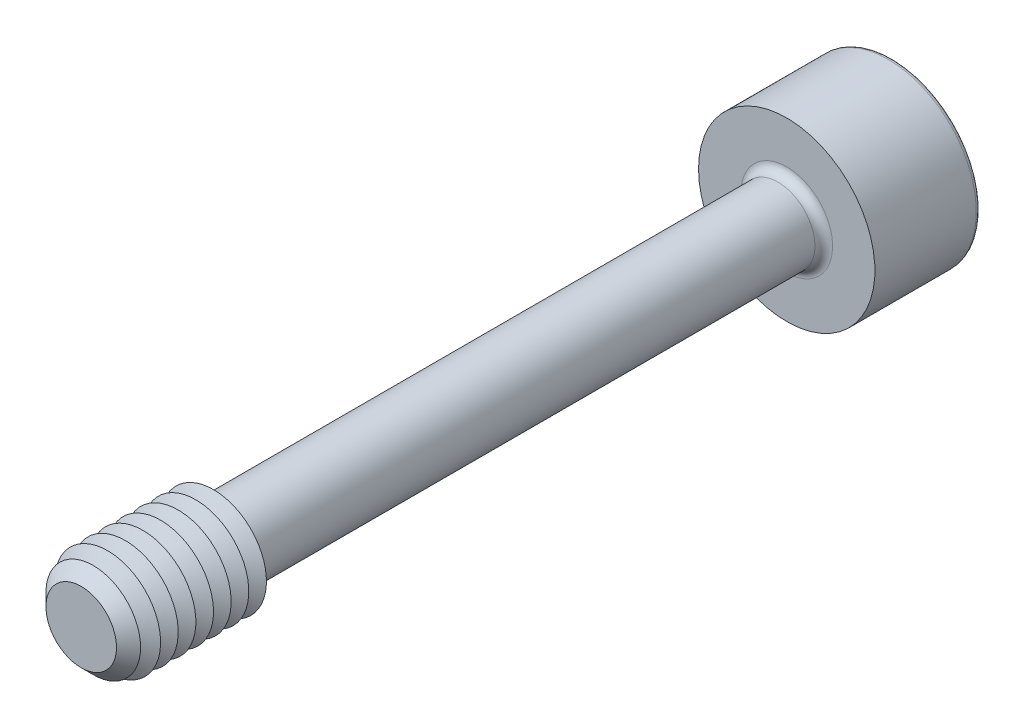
ISO-10303-21;
HEADER;
FILE_DESCRIPTION(('STEP AP214'),'2;1');
FILE_NAME('part.step','',(''),(''),'','','');
FILE_SCHEMA(('AUTOMOTIVE_DESIGN { 1 0 10303 214 1 1 1 1 }'));
ENDSEC;
DATA;
#1=APPLICATION_CONTEXT('core data for automotive mechanical design processes');
#2=APPLICATION_PROTOCOL_DEFINITION('international standard','automotive_design',2000,#1);
#3=PRODUCT_CONTEXT('',#1,'mechanical');
#4=PRODUCT('Part','Part','',(#3));
#5=PRODUCT_RELATED_PRODUCT_CATEGORY('part','',(#4));
#6=PRODUCT_DEFINITION_FORMATION('','',#4);
#7=PRODUCT_DEFINITION_CONTEXT('part definition',#1,'design');
#8=PRODUCT_DEFINITION('design','',#6,#7);
#9=PRODUCT_DEFINITION_SHAPE('','',#8);
#10=(LENGTH_UNIT() NAMED_UNIT(*) SI_UNIT(.MILLI.,.METRE.));
#11=(NAMED_UNIT(*) PLANE_ANGLE_UNIT() SI_UNIT($,.RADIAN.));
#12=(NAMED_UNIT(*) SI_UNIT($,.STERADIAN.) SOLID_ANGLE_UNIT());
#13=UNCERTAINTY_MEASURE_WITH_UNIT(LENGTH_MEASURE(1.E-05),#10,'distance_accuracy_value','');
#14=(GEOMETRIC_REPRESENTATION_CONTEXT(3) GLOBAL_UNCERTAINTY_ASSIGNED_CONTEXT((#13)) GLOBAL_UNIT_ASSIGNED_CONTEXT((#10,
#11,#12)) REPRESENTATION_CONTEXT('',''));
#15=CARTESIAN_POINT('',(0.,0.,0.));
#16=DIRECTION('',(0.,0.,1.));
#17=DIRECTION('',(1.,0.,0.));
#18=AXIS2_PLACEMENT_3D('',#15,#16,#17);
#19=CARTESIAN_POINT('',(-1.44337567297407,-2.5,-21.));
#20=DIRECTION('',(0.,0.,1.));
#21=DIRECTION('',(1.,0.,0.));
#22=AXIS2_PLACEMENT_3D('',#19,#20,#21);
#23=PLANE('',#22);
#24=DIRECTION('',(1.,0.,0.));
#25=VECTOR('',#24,1.);
#26=CARTESIAN_POINT('',(-1.44337567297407,-2.5,-21.));
#27=LINE('',#26,#25);
#28=CARTESIAN_POINT('',(0.,-2.5,-21.));
#29=VERTEX_POINT('',#28);
#30=CARTESIAN_POINT('',(1.44337567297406,-2.5,-21.));
#31=VERTEX_POINT('',#30);
#32=EDGE_CURVE('E729',#29,#31,#27,.T.);
#33=ORIENTED_EDGE('',*,*,#32,.F.);
#34=CARTESIAN_POINT('',(0.,0.,-21.));
#35=DIRECTION('',(0.,0.,1.));
#36=DIRECTION('',(0.,-1.,0.));
#37=AXIS2_PLACEMENT_3D('',#34,#35,#36);
#38=CIRCLE('',#37,2.5);
#39=CARTESIAN_POINT('',(2.1650635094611,-1.25,-21.));
#40=VERTEX_POINT('',#39);
#41=EDGE_CURVE('E53',#29,#40,#38,.T.);
#42=ORIENTED_EDGE('',*,*,#41,.T.);
#43=DIRECTION('',(0.5,0.866025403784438,0.));
#44=VECTOR('',#43,1.);
#45=CARTESIAN_POINT('',(1.44337567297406,-2.5,-21.));
#46=LINE('',#45,#44);
#47=EDGE_CURVE('E713',#31,#40,#46,.T.);
#48=ORIENTED_EDGE('',*,*,#47,.F.);
#49=EDGE_LOOP('',(#33,#42,#48));
#50=FACE_BOUND('',#49,.T.);
#51=ADVANCED_FACE('F41',(#50),#23,.F.);
#52=CARTESIAN_POINT('',(2.88675134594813,0.,-21.));
#53=VERTEX_POINT('',#52);
#54=EDGE_CURVE('E725',#40,#53,#46,.T.);
#55=ORIENTED_EDGE('',*,*,#54,.F.);
#56=CARTESIAN_POINT('',(2.1650635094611,1.25,-21.));
#57=VERTEX_POINT('',#56);
#58=EDGE_CURVE('E11',#40,#57,#38,.T.);
#59=ORIENTED_EDGE('',*,*,#58,.T.);
#60=DIRECTION('',(-0.5,0.866025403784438,0.));
#61=VECTOR('',#60,1.);
#62=CARTESIAN_POINT('',(2.88675134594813,0.,-21.));
#63=LINE('',#62,#61);
#64=EDGE_CURVE('E712',#53,#57,#63,.T.);
#65=ORIENTED_EDGE('',*,*,#64,.F.);
#66=EDGE_LOOP('',(#55,#59,#65));
#67=FACE_BOUND('',#66,.T.);
#68=ADVANCED_FACE('F133',(#67),#23,.F.);
#69=CARTESIAN_POINT('',(1.44337567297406,2.5,-21.));
#70=VERTEX_POINT('',#69);
#71=EDGE_CURVE('E707',#57,#70,#63,.T.);
#72=ORIENTED_EDGE('',*,*,#71,.F.);
#73=CARTESIAN_POINT('',(0.,2.5,-21.));
#74=VERTEX_POINT('',#73);
#75=EDGE_CURVE('E51',#57,#74,#38,.T.);
#76=ORIENTED_EDGE('',*,*,#75,.T.);
#77=DIRECTION('',(-1.,0.,0.));
#78=VECTOR('',#77,1.);
#79=CARTESIAN_POINT('',(1.44337567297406,2.5,-21.));
#80=LINE('',#79,#78);
#81=EDGE_CURVE('E177',#70,#74,#80,.T.);
#82=ORIENTED_EDGE('',*,*,#81,.F.);
#83=EDGE_LOOP('',(#72,#76,#82));
#84=FACE_BOUND('',#83,.T.);
#85=ADVANCED_FACE('F139',(#84),#23,.F.);
#86=CARTESIAN_POINT('',(-1.44337567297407,2.5,-21.));
#87=VERTEX_POINT('',#86);
#88=EDGE_CURVE('E718',#74,#87,#80,.T.);
#89=ORIENTED_EDGE('',*,*,#88,.F.);
#90=CARTESIAN_POINT('',(-2.1650635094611,1.25,-21.));
#91=VERTEX_POINT('',#90);
#92=EDGE_CURVE('E265',#74,#91,#38,.T.);
#93=ORIENTED_EDGE('',*,*,#92,.T.);
#94=DIRECTION('',(-0.5,-0.866025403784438,0.));
#95=VECTOR('',#94,1.);
#96=CARTESIAN_POINT('',(-1.44337567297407,2.5,-21.));
#97=LINE('',#96,#95);
#98=EDGE_CURVE('E176',#87,#91,#97,.T.);
#99=ORIENTED_EDGE('',*,*,#98,.F.);
#100=EDGE_LOOP('',(#89,#93,#99));
#101=FACE_BOUND('',#100,.T.);
#102=ADVANCED_FACE('F157',(#101),#23,.F.);
#103=CARTESIAN_POINT('',(-2.88675134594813,0.,-21.));
#104=VERTEX_POINT('',#103);
#105=EDGE_CURVE('E170',#91,#104,#97,.T.);
#106=ORIENTED_EDGE('',*,*,#105,.F.);
#107=CARTESIAN_POINT('',(-2.1650635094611,-1.25,-21.));
#108=VERTEX_POINT('',#107);
#109=EDGE_CURVE('E172',#91,#108,#38,.T.);
#110=ORIENTED_EDGE('',*,*,#109,.T.);
#111=DIRECTION('',(0.5,-0.866025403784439,0.));
#112=VECTOR('',#111,1.);
#113=CARTESIAN_POINT('',(-2.88675134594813,0.,-21.));
#114=LINE('',#113,#112);
#115=EDGE_CURVE('E174',#104,#108,#114,.T.);
#116=ORIENTED_EDGE('',*,*,#115,.F.);
#117=EDGE_LOOP('',(#106,#110,#116));
#118=FACE_BOUND('',#117,.T.);
#119=ADVANCED_FACE('F146',(#118),#23,.F.);
#120=CARTESIAN_POINT('',(0.,0.,-26.));
#121=DIRECTION('',(0.,0.,-1.));
#122=DIRECTION('',(-1.,0.,0.));
#123=AXIS2_PLACEMENT_3D('',#120,#121,#122);
#124=PLANE('',#123);
#125=CARTESIAN_POINT('',(0.,0.,-26.));
#126=DIRECTION('',(0.,0.,-1.));
#127=DIRECTION('',(-1.,0.,0.));
#128=AXIS2_PLACEMENT_3D('',#125,#126,#127);
#129=CIRCLE('',#128,4.75);
#130=CARTESIAN_POINT('',(-4.75,0.,-26.));
#131=VERTEX_POINT('',#130);
#132=EDGE_CURVE('E251',#131,#131,#129,.T.);
#133=ORIENTED_EDGE('',*,*,#132,.T.);
#134=EDGE_LOOP('',(#133));
#135=FACE_BOUND('',#134,.T.);
#136=DIRECTION('',(-0.5,-0.866025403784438,0.));
#137=VECTOR('',#136,1.);
#138=CARTESIAN_POINT('',(-1.44337567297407,2.5,-26.));
#139=LINE('',#138,#137);
#140=CARTESIAN_POINT('',(-1.44337567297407,2.5,-26.));
#141=VERTEX_POINT('',#140);
#142=CARTESIAN_POINT('',(-2.88675134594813,0.,-26.));
#143=VERTEX_POINT('',#142);
#144=EDGE_CURVE('E212',#141,#143,#139,.T.);
#145=ORIENTED_EDGE('',*,*,#144,.T.);
#146=DIRECTION('',(0.5,-0.866025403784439,0.));
#147=VECTOR('',#146,1.);
#148=CARTESIAN_POINT('',(-2.88675134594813,0.,-26.));
#149=LINE('',#148,#147);
#150=CARTESIAN_POINT('',(-1.44337567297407,-2.5,-26.));
#151=VERTEX_POINT('',#150);
#152=EDGE_CURVE('E67',#143,#151,#149,.T.);
#153=ORIENTED_EDGE('',*,*,#152,.T.);
#154=DIRECTION('',(1.,0.,0.));
#155=VECTOR('',#154,1.);
#156=CARTESIAN_POINT('',(-1.44337567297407,-2.5,-26.));
#157=LINE('',#156,#155);
#158=CARTESIAN_POINT('',(1.44337567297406,-2.5,-26.));
#159=VERTEX_POINT('',#158);
#160=EDGE_CURVE('E196',#151,#159,#157,.T.);
#161=ORIENTED_EDGE('',*,*,#160,.T.);
#162=DIRECTION('',(0.5,0.866025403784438,0.));
#163=VECTOR('',#162,1.);
#164=CARTESIAN_POINT('',(1.44337567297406,-2.5,-26.));
#165=LINE('',#164,#163);
#166=CARTESIAN_POINT('',(2.88675134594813,0.,-26.));
#167=VERTEX_POINT('',#166);
#168=EDGE_CURVE('E200',#159,#167,#165,.T.);
#169=ORIENTED_EDGE('',*,*,#168,.T.);
#170=DIRECTION('',(-0.5,0.866025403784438,0.));
#171=VECTOR('',#170,1.);
#172=CARTESIAN_POINT('',(2.88675134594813,0.,-26.));
#173=LINE('',#172,#171);
#174=CARTESIAN_POINT('',(1.44337567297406,2.5,-26.));
#175=VERTEX_POINT('',#174);
#176=EDGE_CURVE('E204',#167,#175,#173,.T.);
#177=ORIENTED_EDGE('',*,*,#176,.T.);
#178=DIRECTION('',(-1.,0.,0.));
#179=VECTOR('',#178,1.);
#180=CARTESIAN_POINT('',(1.44337567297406,2.5,-26.));
#181=LINE('',#180,#179);
#182=EDGE_CURVE('E208',#175,#141,#181,.T.);
#183=ORIENTED_EDGE('',*,*,#182,.T.);
#184=EDGE_LOOP('',(#145,#153,#161,#169,#177,#183));
#185=FACE_BOUND('',#184,.T.);
#186=ADVANCED_FACE('F156',(#135,#185),#124,.T.);
#187=CARTESIAN_POINT('',(0.,0.,20.));
#188=DIRECTION('',(0.,0.,-1.));
#189=DIRECTION('',(-1.,0.,0.));
#190=AXIS2_PLACEMENT_3D('',#187,#188,#189);
#191=CYLINDRICAL_SURFACE('',#190,2.1);
#192=CARTESIAN_POINT('',(0.,0.,-19.5));
#193=DIRECTION('',(0.,0.,-1.));
#194=DIRECTION('',(-1.,0.,0.));
#195=AXIS2_PLACEMENT_3D('',#192,#193,#194);
#196=CIRCLE('',#195,2.1);
#197=CARTESIAN_POINT('',(-2.1,0.,-19.5));
#198=VERTEX_POINT('',#197);
#199=EDGE_CURVE('E247',#198,#198,#196,.F.);
#200=ORIENTED_EDGE('',*,*,#199,.T.);
#201=EDGE_LOOP('',(#200));
#202=FACE_BOUND('',#201,.T.);
#203=CARTESIAN_POINT('',(0.,0.,11.9803847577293));
#204=DIRECTION('',(0.,0.,-1.));
#205=DIRECTION('',(0.,1.,0.));
#206=AXIS2_PLACEMENT_3D('',#203,#204,#205);
#207=CIRCLE('',#206,2.1);
#208=CARTESIAN_POINT('',(0.,2.1,11.9803847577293));
#209=VERTEX_POINT('',#208);
#210=EDGE_CURVE('E235',#209,#209,#207,.T.);
#211=ORIENTED_EDGE('',*,*,#210,.T.);
#212=EDGE_LOOP('',(#211));
#213=FACE_BOUND('',#212,.T.);
#214=ADVANCED_FACE('F163',(#202,#213),#191,.T.);
#215=CARTESIAN_POINT('',(0.,0.,11.9803847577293));
#216=DIRECTION('',(0.,0.,1.));
#217=DIRECTION('',(0.,-1.,0.));
#218=AXIS2_PLACEMENT_3D('',#215,#216,#217);
#219=CONICAL_SURFACE('',#218,2.1,1.0471975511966);
#220=CARTESIAN_POINT('',(0.,0.,12.5));
#221=DIRECTION('',(0.,0.,-1.));
#222=DIRECTION('',(-1.,0.,0.));
#223=AXIS2_PLACEMENT_3D('',#220,#221,#222);
#224=CIRCLE('',#223,3.);
#225=CARTESIAN_POINT('',(-3.,0.,12.5));
#226=VERTEX_POINT('',#225);
#227=EDGE_CURVE('E269',#226,#226,#224,.T.);
#228=ORIENTED_EDGE('',*,*,#227,.T.);
#229=EDGE_LOOP('',(#228));
#230=FACE_BOUND('',#229,.T.);
#231=ORIENTED_EDGE('',*,*,#210,.F.);
#232=EDGE_LOOP('',(#231));
#233=FACE_BOUND('',#232,.T.);
#234=ADVANCED_FACE('F484',(#230,#233),#219,.T.);
#235=CARTESIAN_POINT('',(0.,0.,-20.));
#236=DIRECTION('',(0.,0.,-1.));
#237=DIRECTION('',(-1.,0.,0.));
#238=AXIS2_PLACEMENT_3D('',#235,#236,#237);
#239=PLANE('',#238);
#240=CARTESIAN_POINT('',(0.,0.,-20.));
#241=DIRECTION('',(0.,0.,-1.));
#242=DIRECTION('',(-1.,0.,0.));
#243=AXIS2_PLACEMENT_3D('',#240,#241,#242);
#244=CIRCLE('',#243,2.6);
#245=CARTESIAN_POINT('',(-2.6,0.,-20.));
#246=VERTEX_POINT('',#245);
#247=EDGE_CURVE('E243',#246,#246,#244,.T.);
#248=ORIENTED_EDGE('',*,*,#247,.T.);
#249=EDGE_LOOP('',(#248));
#250=FACE_BOUND('',#249,.T.);
#251=CARTESIAN_POINT('',(0.,0.,-20.));
#252=DIRECTION('',(0.,0.,-1.));
#253=DIRECTION('',(-1.,0.,0.));
#254=AXIS2_PLACEMENT_3D('',#251,#252,#253);
#255=CIRCLE('',#254,5.);
#256=CARTESIAN_POINT('',(-5.,0.,-20.));
#257=VERTEX_POINT('',#256);
#258=EDGE_CURVE('E231',#257,#257,#255,.T.);
#259=ORIENTED_EDGE('',*,*,#258,.F.);
#260=EDGE_LOOP('',(#259));
#261=FACE_BOUND('',#260,.T.);
#262=ADVANCED_FACE('F477',(#250,#261),#239,.F.);
#263=CARTESIAN_POINT('',(0.,0.,-26.));
#264=DIRECTION('',(0.,0.,1.));
#265=DIRECTION('',(1.,0.,0.));
#266=AXIS2_PLACEMENT_3D('',#263,#264,#265);
#267=CYLINDRICAL_SURFACE('',#266,5.);
#268=CARTESIAN_POINT('',(0.,0.,-25.75));
#269=DIRECTION('',(0.,0.,-1.));
#270=DIRECTION('',(-1.,0.,0.));
#271=AXIS2_PLACEMENT_3D('',#268,#269,#270);
#272=CIRCLE('',#271,5.);
#273=CARTESIAN_POINT('',(-5.,0.,-25.75));
#274=VERTEX_POINT('',#273);
#275=EDGE_CURVE('E254',#274,#274,#272,.F.);
#276=ORIENTED_EDGE('',*,*,#275,.T.);
#277=EDGE_LOOP('',(#276));
#278=FACE_BOUND('',#277,.T.);
#279=ORIENTED_EDGE('',*,*,#258,.T.);
#280=EDGE_LOOP('',(#279));
#281=FACE_BOUND('',#280,.T.);
#282=ADVANCED_FACE('F483',(#278,#281),#267,.T.);
#283=CARTESIAN_POINT('',(-2.88675134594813,0.,-21.));
#284=DIRECTION('',(0.866025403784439,0.5,0.));
#285=DIRECTION('',(-0.5,0.866025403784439,0.));
#286=AXIS2_PLACEMENT_3D('',#283,#284,#285);
#287=PLANE('',#286);
#288=ORIENTED_EDGE('',*,*,#152,.F.);
#289=DIRECTION('',(0.,0.,-1.));
#290=VECTOR('',#289,1.);
#291=CARTESIAN_POINT('',(-2.88675134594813,0.,-21.));
#292=LINE('',#291,#290);
#293=EDGE_CURVE('E186',#104,#143,#292,.T.);
#294=ORIENTED_EDGE('',*,*,#293,.F.);
#295=ORIENTED_EDGE('',*,*,#115,.T.);
#296=CARTESIAN_POINT('',(-1.44337567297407,-2.5,-21.));
#297=VERTEX_POINT('',#296);
#298=EDGE_CURVE('E215',#108,#297,#114,.T.);
#299=ORIENTED_EDGE('',*,*,#298,.T.);
#300=DIRECTION('',(0.,0.,-1.));
#301=VECTOR('',#300,1.);
#302=CARTESIAN_POINT('',(-1.44337567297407,-2.5,-21.));
#303=LINE('',#302,#301);
#304=EDGE_CURVE('E228',#297,#151,#303,.T.);
#305=ORIENTED_EDGE('',*,*,#304,.T.);
#306=EDGE_LOOP('',(#288,#294,#295,#299,#305));
#307=FACE_BOUND('',#306,.T.);
#308=ADVANCED_FACE('F495',(#307),#287,.T.);
#309=CARTESIAN_POINT('',(-1.44337567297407,-2.5,-21.));
#310=DIRECTION('',(0.,1.,0.));
#311=DIRECTION('',(-1.,0.,0.));
#312=AXIS2_PLACEMENT_3D('',#309,#310,#311);
#313=PLANE('',#312);
#314=ORIENTED_EDGE('',*,*,#160,.F.);
#315=ORIENTED_EDGE('',*,*,#304,.F.);
#316=EDGE_CURVE('E726',#297,#29,#27,.T.);
#317=ORIENTED_EDGE('',*,*,#316,.T.);
#318=ORIENTED_EDGE('',*,*,#32,.T.);
#319=DIRECTION('',(0.,0.,-1.));
#320=VECTOR('',#319,1.);
#321=CARTESIAN_POINT('',(1.44337567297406,-2.5,-21.));
#322=LINE('',#321,#320);
#323=EDGE_CURVE('E225',#31,#159,#322,.T.);
#324=ORIENTED_EDGE('',*,*,#323,.T.);
#325=EDGE_LOOP('',(#314,#315,#317,#318,#324));
#326=FACE_BOUND('',#325,.T.);
#327=ADVANCED_FACE('F511',(#326),#313,.T.);
#328=CARTESIAN_POINT('',(1.44337567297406,-2.5,-21.));
#329=DIRECTION('',(-0.866025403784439,0.5,0.));
#330=DIRECTION('',(-0.5,-0.866025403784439,0.));
#331=AXIS2_PLACEMENT_3D('',#328,#329,#330);
#332=PLANE('',#331);
#333=ORIENTED_EDGE('',*,*,#168,.F.);
#334=ORIENTED_EDGE('',*,*,#323,.F.);
#335=ORIENTED_EDGE('',*,*,#47,.T.);
#336=ORIENTED_EDGE('',*,*,#54,.T.);
#337=DIRECTION('',(0.,0.,-1.));
#338=VECTOR('',#337,1.);
#339=CARTESIAN_POINT('',(2.88675134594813,0.,-21.));
#340=LINE('',#339,#338);
#341=EDGE_CURVE('E222',#53,#167,#340,.T.);
#342=ORIENTED_EDGE('',*,*,#341,.T.);
#343=EDGE_LOOP('',(#333,#334,#335,#336,#342));
#344=FACE_BOUND('',#343,.T.);
#345=ADVANCED_FACE('F521',(#344),#332,.T.);
#346=CARTESIAN_POINT('',(2.88675134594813,0.,-21.));
#347=DIRECTION('',(-0.866025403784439,-0.5,0.));
#348=DIRECTION('',(0.5,-0.866025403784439,0.));
#349=AXIS2_PLACEMENT_3D('',#346,#347,#348);
#350=PLANE('',#349);
#351=ORIENTED_EDGE('',*,*,#176,.F.);
#352=ORIENTED_EDGE('',*,*,#341,.F.);
#353=ORIENTED_EDGE('',*,*,#64,.T.);
#354=ORIENTED_EDGE('',*,*,#71,.T.);
#355=DIRECTION('',(0.,0.,-1.));
#356=VECTOR('',#355,1.);
#357=CARTESIAN_POINT('',(1.44337567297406,2.5,-21.));
#358=LINE('',#357,#356);
#359=EDGE_CURVE('E219',#70,#175,#358,.T.);
#360=ORIENTED_EDGE('',*,*,#359,.T.);
#361=EDGE_LOOP('',(#351,#352,#353,#354,#360));
#362=FACE_BOUND('',#361,.T.);
#363=ADVANCED_FACE('F531',(#362),#350,.T.);
#364=CARTESIAN_POINT('',(1.44337567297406,2.5,-21.));
#365=DIRECTION('',(0.,-1.,0.));
#366=DIRECTION('',(0.,0.,-1.));
#367=AXIS2_PLACEMENT_3D('',#364,#365,#366);
#368=PLANE('',#367);
#369=ORIENTED_EDGE('',*,*,#182,.F.);
#370=ORIENTED_EDGE('',*,*,#359,.F.);
#371=ORIENTED_EDGE('',*,*,#81,.T.);
#372=ORIENTED_EDGE('',*,*,#88,.T.);
#373=DIRECTION('',(0.,0.,-1.));
#374=VECTOR('',#373,1.);
#375=CARTESIAN_POINT('',(-1.44337567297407,2.5,-21.));
#376=LINE('',#375,#374);
#377=EDGE_CURVE('E182',#87,#141,#376,.T.);
#378=ORIENTED_EDGE('',*,*,#377,.T.);
#379=EDGE_LOOP('',(#369,#370,#371,#372,#378));
#380=FACE_BOUND('',#379,.T.);
#381=ADVANCED_FACE('F152',(#380),#368,.T.);
#382=CARTESIAN_POINT('',(-1.44337567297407,2.5,-21.));
#383=DIRECTION('',(0.866025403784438,-0.5,0.));
#384=DIRECTION('',(0.5,0.866025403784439,0.));
#385=AXIS2_PLACEMENT_3D('',#382,#383,#384);
#386=PLANE('',#385);
#387=ORIENTED_EDGE('',*,*,#144,.F.);
#388=ORIENTED_EDGE('',*,*,#377,.F.);
#389=ORIENTED_EDGE('',*,*,#98,.T.);
#390=ORIENTED_EDGE('',*,*,#105,.T.);
#391=ORIENTED_EDGE('',*,*,#293,.T.);
#392=EDGE_LOOP('',(#387,#388,#389,#390,#391));
#393=FACE_BOUND('',#392,.T.);
#394=ADVANCED_FACE('F144',(#393),#386,.T.);
#395=ORIENTED_EDGE('',*,*,#298,.F.);
#396=EDGE_CURVE('E257',#108,#29,#38,.T.);
#397=ORIENTED_EDGE('',*,*,#396,.T.);
#398=ORIENTED_EDGE('',*,*,#316,.F.);
#399=EDGE_LOOP('',(#395,#397,#398));
#400=FACE_BOUND('',#399,.T.);
#401=ADVANCED_FACE('F135',(#400),#23,.F.);
#402=CARTESIAN_POINT('',(0.,0.,-19.5));
#403=DIRECTION('',(0.,0.,-1.));
#404=DIRECTION('',(-1.,0.,0.));
#405=AXIS2_PLACEMENT_3D('',#402,#403,#404);
#406=TOROIDAL_SURFACE('',#405,2.6,0.5);
#407=ORIENTED_EDGE('',*,*,#199,.F.);
#408=EDGE_LOOP('',(#407));
#409=FACE_BOUND('',#408,.T.);
#410=ORIENTED_EDGE('',*,*,#247,.F.);
#411=EDGE_LOOP('',(#410));
#412=FACE_BOUND('',#411,.T.);
#413=ADVANCED_FACE('F129',(#409,#412),#406,.F.);
#414=CARTESIAN_POINT('',(0.,0.,-25.75));
#415=DIRECTION('',(0.,0.,-1.));
#416=DIRECTION('',(-1.,0.,0.));
#417=AXIS2_PLACEMENT_3D('',#414,#415,#416);
#418=TOROIDAL_SURFACE('',#417,4.75,0.25);
#419=ORIENTED_EDGE('',*,*,#275,.F.);
#420=EDGE_LOOP('',(#419));
#421=FACE_BOUND('',#420,.T.);
#422=ORIENTED_EDGE('',*,*,#132,.F.);
#423=EDGE_LOOP('',(#422));
#424=FACE_BOUND('',#423,.T.);
#425=ADVANCED_FACE('F43',(#421,#424),#418,.T.);
#426=CARTESIAN_POINT('',(0.,0.,-19.556624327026));
#427=DIRECTION('',(0.,0.,-1.));
#428=DIRECTION('',(0.,1.,0.));
#429=AXIS2_PLACEMENT_3D('',#426,#427,#428);
#430=CONICAL_SURFACE('',#429,0.,1.0471975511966);
#431=ORIENTED_EDGE('',*,*,#41,.F.);
#432=ORIENTED_EDGE('',*,*,#396,.F.);
#433=ORIENTED_EDGE('',*,*,#109,.F.);
#434=ORIENTED_EDGE('',*,*,#92,.F.);
#435=ORIENTED_EDGE('',*,*,#75,.F.);
#436=ORIENTED_EDGE('',*,*,#58,.F.);
#437=EDGE_LOOP('',(#431,#432,#433,#434,#435,#436));
#438=FACE_BOUND('',#437,.T.);
#439=CARTESIAN_POINT('',(0.,0.,-19.556624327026));
#440=VERTEX_POINT('',#439);
#441=VERTEX_LOOP('',#440);
#442=FACE_BOUND('',#441,.T.);
#443=ADVANCED_FACE('F118',(#438,#442),#430,.F.);
#444=CARTESIAN_POINT('',(0.,0.,13.));
#445=DIRECTION('',(0.,0.,-1.));
#446=DIRECTION('',(-1.,0.,0.));
#447=AXIS2_PLACEMENT_3D('',#444,#445,#446);
#448=CONICAL_SURFACE('',#447,2.13397459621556,1.0471975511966);
#449=ORIENTED_EDGE('',*,*,#227,.F.);
#450=EDGE_LOOP('',(#449));
#451=FACE_BOUND('',#450,.T.);
#452=CARTESIAN_POINT('',(0.,0.,13.));
#453=DIRECTION('',(0.,0.,-1.));
#454=DIRECTION('',(-1.,0.,0.));
#455=AXIS2_PLACEMENT_3D('',#452,#453,#454);
#456=CIRCLE('',#455,2.13397459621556);
#457=CARTESIAN_POINT('',(-2.13397459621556,0.,13.));
#458=VERTEX_POINT('',#457);
#459=EDGE_CURVE('E275',#458,#458,#456,.T.);
#460=ORIENTED_EDGE('',*,*,#459,.T.);
#461=EDGE_LOOP('',(#460));
#462=FACE_BOUND('',#461,.T.);
#463=ADVANCED_FACE('F120',(#451,#462),#448,.T.);
#464=CARTESIAN_POINT('',(0.,0.,13.5));
#465=DIRECTION('',(0.,0.,1.));
#466=DIRECTION('',(1.,0.,0.));
#467=AXIS2_PLACEMENT_3D('',#464,#465,#466);
#468=CONICAL_SURFACE('',#467,3.,1.0471975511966);
#469=ORIENTED_EDGE('',*,*,#459,.F.);
#470=EDGE_LOOP('',(#469));
#471=FACE_BOUND('',#470,.T.);
#472=CARTESIAN_POINT('',(0.,0.,13.5));
#473=DIRECTION('',(0.,0.,-1.));
#474=DIRECTION('',(-1.,0.,0.));
#475=AXIS2_PLACEMENT_3D('',#472,#473,#474);
#476=CIRCLE('',#475,3.);
#477=CARTESIAN_POINT('',(-3.,0.,13.5));
#478=VERTEX_POINT('',#477);
#479=EDGE_CURVE('E281',#478,#478,#476,.T.);
#480=ORIENTED_EDGE('',*,*,#479,.T.);
#481=EDGE_LOOP('',(#480));
#482=FACE_BOUND('',#481,.T.);
#483=ADVANCED_FACE('F126',(#471,#482),#468,.T.);
#484=CARTESIAN_POINT('',(0.,0.,14.));
#485=DIRECTION('',(0.,0.,-1.));
#486=DIRECTION('',(-1.,0.,0.));
#487=AXIS2_PLACEMENT_3D('',#484,#485,#486);
#488=CONICAL_SURFACE('',#487,2.13397459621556,1.0471975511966);
#489=ORIENTED_EDGE('',*,*,#479,.F.);
#490=EDGE_LOOP('',(#489));
#491=FACE_BOUND('',#490,.T.);
#492=CARTESIAN_POINT('',(0.,0.,14.));
#493=DIRECTION('',(0.,0.,-1.));
#494=DIRECTION('',(-1.,0.,0.));
#495=AXIS2_PLACEMENT_3D('',#492,#493,#494);
#496=CIRCLE('',#495,2.13397459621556);
#497=CARTESIAN_POINT('',(-2.13397459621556,0.,14.));
#498=VERTEX_POINT('',#497);
#499=EDGE_CURVE('E287',#498,#498,#496,.T.);
#500=ORIENTED_EDGE('',*,*,#499,.T.);
#501=EDGE_LOOP('',(#500));
#502=FACE_BOUND('',#501,.T.);
#503=ADVANCED_FACE('F381',(#491,#502),#488,.T.);
#504=CARTESIAN_POINT('',(0.,0.,14.5));
#505=DIRECTION('',(0.,0.,1.));
#506=DIRECTION('',(1.,0.,0.));
#507=AXIS2_PLACEMENT_3D('',#504,#505,#506);
#508=CONICAL_SURFACE('',#507,3.,1.0471975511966);
#509=ORIENTED_EDGE('',*,*,#499,.F.);
#510=EDGE_LOOP('',(#509));
#511=FACE_BOUND('',#510,.T.);
#512=CARTESIAN_POINT('',(0.,0.,14.5));
#513=DIRECTION('',(0.,0.,-1.));
#514=DIRECTION('',(-1.,0.,0.));
#515=AXIS2_PLACEMENT_3D('',#512,#513,#514);
#516=CIRCLE('',#515,3.);
#517=CARTESIAN_POINT('',(-3.,0.,14.5));
#518=VERTEX_POINT('',#517);
#519=EDGE_CURVE('E291',#518,#518,#516,.T.);
#520=ORIENTED_EDGE('',*,*,#519,.T.);
#521=EDGE_LOOP('',(#520));
#522=FACE_BOUND('',#521,.T.);
#523=ADVANCED_FACE('F377',(#511,#522),#508,.T.);
#524=CARTESIAN_POINT('',(0.,0.,15.));
#525=DIRECTION('',(0.,0.,-1.));
#526=DIRECTION('',(-1.,0.,0.));
#527=AXIS2_PLACEMENT_3D('',#524,#525,#526);
#528=CONICAL_SURFACE('',#527,2.13397459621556,1.0471975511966);
#529=ORIENTED_EDGE('',*,*,#519,.F.);
#530=EDGE_LOOP('',(#529));
#531=FACE_BOUND('',#530,.T.);
#532=CARTESIAN_POINT('',(0.,0.,15.));
#533=DIRECTION('',(0.,0.,-1.));
#534=DIRECTION('',(-1.,0.,0.));
#535=AXIS2_PLACEMENT_3D('',#532,#533,#534);
#536=CIRCLE('',#535,2.13397459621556);
#537=CARTESIAN_POINT('',(-2.13397459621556,0.,15.));
#538=VERTEX_POINT('',#537);
#539=EDGE_CURVE('E295',#538,#538,#536,.T.);
#540=ORIENTED_EDGE('',*,*,#539,.T.);
#541=EDGE_LOOP('',(#540));
#542=FACE_BOUND('',#541,.T.);
#543=ADVANCED_FACE('F373',(#531,#542),#528,.T.);
#544=CARTESIAN_POINT('',(0.,0.,15.5));
#545=DIRECTION('',(0.,0.,1.));
#546=DIRECTION('',(1.,0.,0.));
#547=AXIS2_PLACEMENT_3D('',#544,#545,#546);
#548=CONICAL_SURFACE('',#547,3.,1.0471975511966);
#549=ORIENTED_EDGE('',*,*,#539,.F.);
#550=EDGE_LOOP('',(#549));
#551=FACE_BOUND('',#550,.T.);
#552=CARTESIAN_POINT('',(0.,0.,15.5));
#553=DIRECTION('',(0.,0.,-1.));
#554=DIRECTION('',(-1.,0.,0.));
#555=AXIS2_PLACEMENT_3D('',#552,#553,#554);
#556=CIRCLE('',#555,3.);
#557=CARTESIAN_POINT('',(-3.,0.,15.5));
#558=VERTEX_POINT('',#557);
#559=EDGE_CURVE('E299',#558,#558,#556,.T.);
#560=ORIENTED_EDGE('',*,*,#559,.T.);
#561=EDGE_LOOP('',(#560));
#562=FACE_BOUND('',#561,.T.);
#563=ADVANCED_FACE('F369',(#551,#562),#548,.T.);
#564=CARTESIAN_POINT('',(0.,0.,16.));
#565=DIRECTION('',(0.,0.,-1.));
#566=DIRECTION('',(-1.,0.,0.));
#567=AXIS2_PLACEMENT_3D('',#564,#565,#566);
#568=CONICAL_SURFACE('',#567,2.13397459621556,1.0471975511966);
#569=ORIENTED_EDGE('',*,*,#559,.F.);
#570=EDGE_LOOP('',(#569));
#571=FACE_BOUND('',#570,.T.);
#572=CARTESIAN_POINT('',(0.,0.,16.));
#573=DIRECTION('',(0.,0.,-1.));
#574=DIRECTION('',(-1.,0.,0.));
#575=AXIS2_PLACEMENT_3D('',#572,#573,#574);
#576=CIRCLE('',#575,2.13397459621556);
#577=CARTESIAN_POINT('',(-2.13397459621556,0.,16.));
#578=VERTEX_POINT('',#577);
#579=EDGE_CURVE('E303',#578,#578,#576,.T.);
#580=ORIENTED_EDGE('',*,*,#579,.T.);
#581=EDGE_LOOP('',(#580));
#582=FACE_BOUND('',#581,.T.);
#583=ADVANCED_FACE('F365',(#571,#582),#568,.T.);
#584=CARTESIAN_POINT('',(0.,0.,16.5));
#585=DIRECTION('',(0.,0.,1.));
#586=DIRECTION('',(1.,0.,0.));
#587=AXIS2_PLACEMENT_3D('',#584,#585,#586);
#588=CONICAL_SURFACE('',#587,3.,1.0471975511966);
#589=ORIENTED_EDGE('',*,*,#579,.F.);
#590=EDGE_LOOP('',(#589));
#591=FACE_BOUND('',#590,.T.);
#592=CARTESIAN_POINT('',(0.,0.,16.5));
#593=DIRECTION('',(0.,0.,-1.));
#594=DIRECTION('',(-1.,0.,0.));
#595=AXIS2_PLACEMENT_3D('',#592,#593,#594);
#596=CIRCLE('',#595,3.);
#597=CARTESIAN_POINT('',(-3.,0.,16.5));
#598=VERTEX_POINT('',#597);
#599=EDGE_CURVE('E306',#598,#598,#596,.T.);
#600=ORIENTED_EDGE('',*,*,#599,.T.);
#601=EDGE_LOOP('',(#600));
#602=FACE_BOUND('',#601,.T.);
#603=ADVANCED_FACE('F361',(#591,#602),#588,.T.);
#604=CARTESIAN_POINT('',(0.,0.,17.));
#605=DIRECTION('',(0.,0.,-1.));
#606=DIRECTION('',(-1.,0.,0.));
#607=AXIS2_PLACEMENT_3D('',#604,#605,#606);
#608=CONICAL_SURFACE('',#607,2.13397459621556,1.0471975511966);
#609=ORIENTED_EDGE('',*,*,#599,.F.);
#610=EDGE_LOOP('',(#609));
#611=FACE_BOUND('',#610,.T.);
#612=CARTESIAN_POINT('',(0.,0.,17.));
#613=DIRECTION('',(0.,0.,-1.));
#614=DIRECTION('',(-1.,0.,0.));
#615=AXIS2_PLACEMENT_3D('',#612,#613,#614);
#616=CIRCLE('',#615,2.13397459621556);
#617=CARTESIAN_POINT('',(-2.13397459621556,0.,17.));
#618=VERTEX_POINT('',#617);
#619=EDGE_CURVE('E309',#618,#618,#616,.T.);
#620=ORIENTED_EDGE('',*,*,#619,.T.);
#621=EDGE_LOOP('',(#620));
#622=FACE_BOUND('',#621,.T.);
#623=ADVANCED_FACE('F357',(#611,#622),#608,.T.);
#624=CARTESIAN_POINT('',(0.,0.,17.5));
#625=DIRECTION('',(0.,0.,1.));
#626=DIRECTION('',(1.,0.,0.));
#627=AXIS2_PLACEMENT_3D('',#624,#625,#626);
#628=CONICAL_SURFACE('',#627,3.,1.0471975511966);
#629=ORIENTED_EDGE('',*,*,#619,.F.);
#630=EDGE_LOOP('',(#629));
#631=FACE_BOUND('',#630,.T.);
#632=CARTESIAN_POINT('',(0.,0.,17.5));
#633=DIRECTION('',(0.,0.,-1.));
#634=DIRECTION('',(-1.,0.,0.));
#635=AXIS2_PLACEMENT_3D('',#632,#633,#634);
#636=CIRCLE('',#635,3.);
#637=CARTESIAN_POINT('',(-3.,0.,17.5));
#638=VERTEX_POINT('',#637);
#639=EDGE_CURVE('E313',#638,#638,#636,.T.);
#640=ORIENTED_EDGE('',*,*,#639,.T.);
#641=EDGE_LOOP('',(#640));
#642=FACE_BOUND('',#641,.T.);
#643=ADVANCED_FACE('F353',(#631,#642),#628,.T.);
#644=CARTESIAN_POINT('',(0.,0.,18.));
#645=DIRECTION('',(0.,0.,-1.));
#646=DIRECTION('',(-1.,0.,0.));
#647=AXIS2_PLACEMENT_3D('',#644,#645,#646);
#648=CONICAL_SURFACE('',#647,2.13397459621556,1.0471975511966);
#649=ORIENTED_EDGE('',*,*,#639,.F.);
#650=EDGE_LOOP('',(#649));
#651=FACE_BOUND('',#650,.T.);
#652=CARTESIAN_POINT('',(0.,0.,18.));
#653=DIRECTION('',(0.,0.,-1.));
#654=DIRECTION('',(-1.,0.,0.));
#655=AXIS2_PLACEMENT_3D('',#652,#653,#654);
#656=CIRCLE('',#655,2.13397459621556);
#657=CARTESIAN_POINT('',(-2.13397459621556,0.,18.));
#658=VERTEX_POINT('',#657);
#659=EDGE_CURVE('E316',#658,#658,#656,.T.);
#660=ORIENTED_EDGE('',*,*,#659,.T.);
#661=EDGE_LOOP('',(#660));
#662=FACE_BOUND('',#661,.T.);
#663=ADVANCED_FACE('F349',(#651,#662),#648,.T.);
#664=CARTESIAN_POINT('',(0.,0.,18.5));
#665=DIRECTION('',(0.,0.,1.));
#666=DIRECTION('',(1.,0.,0.));
#667=AXIS2_PLACEMENT_3D('',#664,#665,#666);
#668=CONICAL_SURFACE('',#667,3.,1.0471975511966);
#669=ORIENTED_EDGE('',*,*,#659,.F.);
#670=EDGE_LOOP('',(#669));
#671=FACE_BOUND('',#670,.T.);
#672=CARTESIAN_POINT('',(0.,0.,18.5));
#673=DIRECTION('',(0.,0.,-1.));
#674=DIRECTION('',(-1.,0.,0.));
#675=AXIS2_PLACEMENT_3D('',#672,#673,#674);
#676=CIRCLE('',#675,3.);
#677=CARTESIAN_POINT('',(-3.,0.,18.5));
#678=VERTEX_POINT('',#677);
#679=EDGE_CURVE('E320',#678,#678,#676,.T.);
#680=ORIENTED_EDGE('',*,*,#679,.T.);
#681=EDGE_LOOP('',(#680));
#682=FACE_BOUND('',#681,.T.);
#683=ADVANCED_FACE('F342',(#671,#682),#668,.T.);
#684=CARTESIAN_POINT('',(0.,0.,19.));
#685=DIRECTION('',(0.,0.,-1.));
#686=DIRECTION('',(-1.,0.,0.));
#687=AXIS2_PLACEMENT_3D('',#684,#685,#686);
#688=CONICAL_SURFACE('',#687,2.13397459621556,1.0471975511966);
#689=ORIENTED_EDGE('',*,*,#679,.F.);
#690=EDGE_LOOP('',(#689));
#691=FACE_BOUND('',#690,.T.);
#692=CARTESIAN_POINT('',(0.,0.,19.));
#693=DIRECTION('',(0.,0.,-1.));
#694=DIRECTION('',(-1.,0.,0.));
#695=AXIS2_PLACEMENT_3D('',#692,#693,#694);
#696=CIRCLE('',#695,2.13397459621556);
#697=CARTESIAN_POINT('',(-2.13397459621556,0.,19.));
#698=VERTEX_POINT('',#697);
#699=EDGE_CURVE('E323',#698,#698,#696,.T.);
#700=ORIENTED_EDGE('',*,*,#699,.T.);
#701=EDGE_LOOP('',(#700));
#702=FACE_BOUND('',#701,.T.);
#703=ADVANCED_FACE('F328',(#691,#702),#688,.T.);
#704=CARTESIAN_POINT('',(0.,0.,19.5));
#705=DIRECTION('',(0.,0.,1.));
#706=DIRECTION('',(1.,0.,0.));
#707=AXIS2_PLACEMENT_3D('',#704,#705,#706);
#708=CONICAL_SURFACE('',#707,3.,1.0471975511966);
#709=CARTESIAN_POINT('',(0.,0.,19.3169872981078));
#710=DIRECTION('',(0.,0.,1.));
#711=DIRECTION('',(1.,0.,0.));
#712=AXIS2_PLACEMENT_3D('',#709,#710,#711);
#713=CIRCLE('',#712,2.68301270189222);
#714=CARTESIAN_POINT('',(2.68301270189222,0.,19.3169872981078));
#715=VERTEX_POINT('',#714);
#716=EDGE_CURVE('E45',#715,#715,#713,.F.);
#717=ORIENTED_EDGE('',*,*,#716,.T.);
#718=EDGE_LOOP('',(#717));
#719=FACE_BOUND('',#718,.T.);
#720=ORIENTED_EDGE('',*,*,#699,.F.);
#721=EDGE_LOOP('',(#720));
#722=FACE_BOUND('',#721,.T.);
#723=ADVANCED_FACE('F330',(#719,#722),#708,.T.);
#724=CARTESIAN_POINT('',(0.,0.,20.));
#725=DIRECTION('',(0.,0.,1.));
#726=DIRECTION('',(1.,0.,0.));
#727=AXIS2_PLACEMENT_3D('',#724,#725,#726);
#728=PLANE('',#727);
#729=CARTESIAN_POINT('',(0.,0.,20.));
#730=DIRECTION('',(0.,0.,1.));
#731=DIRECTION('',(1.,0.,0.));
#732=AXIS2_PLACEMENT_3D('',#729,#730,#731);
#733=CIRCLE('',#732,2.);
#734=CARTESIAN_POINT('',(2.,0.,20.));
#735=VERTEX_POINT('',#734);
#736=EDGE_CURVE('E239',#735,#735,#733,.T.);
#737=ORIENTED_EDGE('',*,*,#736,.T.);
#738=EDGE_LOOP('',(#737));
#739=FACE_BOUND('',#738,.T.);
#740=ADVANCED_FACE('F332',(#739),#728,.T.);
#741=CARTESIAN_POINT('',(0.,0.,19.));
#742=DIRECTION('',(0.,0.,-1.));
#743=DIRECTION('',(0.,1.,0.));
#744=AXIS2_PLACEMENT_3D('',#741,#742,#743);
#745=CONICAL_SURFACE('',#744,3.,0.785398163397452);
#746=ORIENTED_EDGE('',*,*,#716,.F.);
#747=EDGE_LOOP('',(#746));
#748=FACE_BOUND('',#747,.T.);
#749=ORIENTED_EDGE('',*,*,#736,.F.);
#750=EDGE_LOOP('',(#749));
#751=FACE_BOUND('',#750,.T.);
#752=ADVANCED_FACE('F339',(#748,#751),#745,.T.);
#753=CLOSED_SHELL('',(#51,#68,#85,#102,#119,#186,#214,#234,#262,#282,#308,#327,#345,#363,#381,
#394,#401,#413,#425,#443,#463,#483,#503,#523,#543,#563,#583,#603,#623,#643,#663,#683,#703,#723,
#740,#752));
#754=MANIFOLD_SOLID_BREP('B2',#753);
#755=ADVANCED_BREP_SHAPE_REPRESENTATION('',(#18,#754),#14);
#756=SHAPE_DEFINITION_REPRESENTATION(#9,#755);
ENDSEC;
END-ISO-10303-21;
